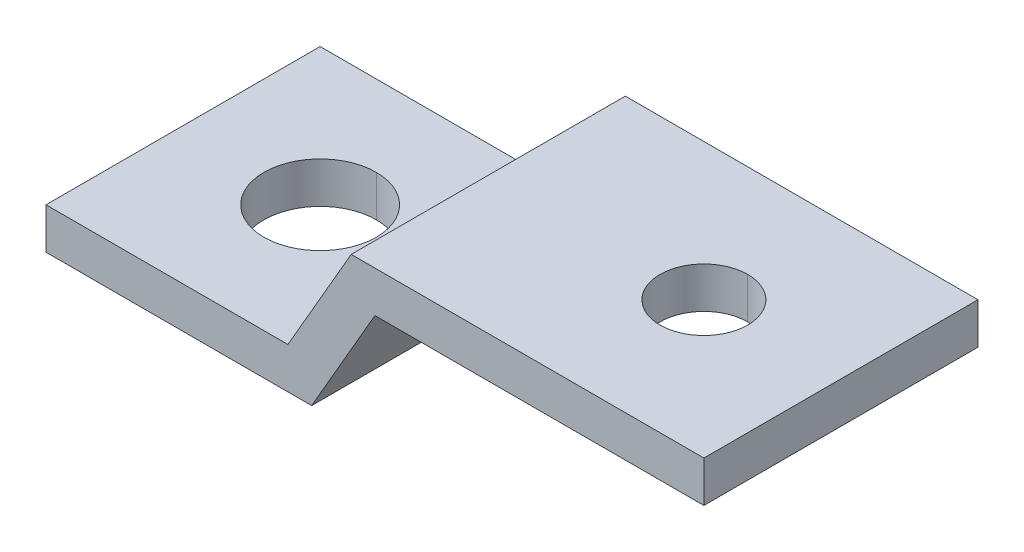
ISO-10303-21;
HEADER;
FILE_DESCRIPTION(('STEP AP214'),'2;1');
FILE_NAME('part.step','',(''),(''),'','','');
FILE_SCHEMA(('AUTOMOTIVE_DESIGN { 1 0 10303 214 1 1 1 1 }'));
ENDSEC;
DATA;
#1=APPLICATION_CONTEXT('core data for automotive mechanical design processes');
#2=APPLICATION_PROTOCOL_DEFINITION('international standard','automotive_design',2000,#1);
#3=PRODUCT_CONTEXT('',#1,'mechanical');
#4=PRODUCT('Part','Part','',(#3));
#5=PRODUCT_RELATED_PRODUCT_CATEGORY('part','',(#4));
#6=PRODUCT_DEFINITION_FORMATION('','',#4);
#7=PRODUCT_DEFINITION_CONTEXT('part definition',#1,'design');
#8=PRODUCT_DEFINITION('design','',#6,#7);
#9=PRODUCT_DEFINITION_SHAPE('','',#8);
#10=(LENGTH_UNIT() NAMED_UNIT(*) SI_UNIT(.MILLI.,.METRE.));
#11=(NAMED_UNIT(*) PLANE_ANGLE_UNIT() SI_UNIT($,.RADIAN.));
#12=(NAMED_UNIT(*) SI_UNIT($,.STERADIAN.) SOLID_ANGLE_UNIT());
#13=UNCERTAINTY_MEASURE_WITH_UNIT(LENGTH_MEASURE(1.E-05),#10,'distance_accuracy_value','');
#14=(GEOMETRIC_REPRESENTATION_CONTEXT(3) GLOBAL_UNCERTAINTY_ASSIGNED_CONTEXT((#13)) GLOBAL_UNIT_ASSIGNED_CONTEXT((#10,
#11,#12)) REPRESENTATION_CONTEXT('',''));
#15=CARTESIAN_POINT('',(0.,0.,0.));
#16=DIRECTION('',(0.,0.,1.));
#17=DIRECTION('',(1.,0.,0.));
#18=AXIS2_PLACEMENT_3D('',#15,#16,#17);
#19=CARTESIAN_POINT('',(2.89110178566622,3.9188977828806,17.2699844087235));
#20=DIRECTION('',(0.,1.,0.));
#21=DIRECTION('',(0.,0.,1.));
#22=AXIS2_PLACEMENT_3D('',#19,#20,#21);
#23=CYLINDRICAL_SURFACE('',#22,2.05);
#24=DIRECTION('',(0.,1.,0.));
#25=VECTOR('',#24,1.);
#26=CARTESIAN_POINT('',(2.89110178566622,3.9188977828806,15.2199844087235));
#27=LINE('',#26,#25);
#28=CARTESIAN_POINT('',(2.89110178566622,9.71717338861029,15.2199844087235));
#29=VERTEX_POINT('',#28);
#30=CARTESIAN_POINT('',(2.89110178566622,11.2171733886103,15.2199844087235));
#31=VERTEX_POINT('',#30);
#32=EDGE_CURVE('E144',#29,#31,#27,.T.);
#33=ORIENTED_EDGE('',*,*,#32,.F.);
#34=CARTESIAN_POINT('',(2.89110178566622,9.71717338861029,17.2699844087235));
#35=DIRECTION('',(0.,1.,0.));
#36=DIRECTION('',(0.,0.,1.));
#37=AXIS2_PLACEMENT_3D('',#34,#35,#36);
#38=CIRCLE('',#37,2.05);
#39=CARTESIAN_POINT('',(2.89110178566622,9.71717338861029,19.3199844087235));
#40=VERTEX_POINT('',#39);
#41=EDGE_CURVE('E130',#40,#29,#38,.T.);
#42=ORIENTED_EDGE('',*,*,#41,.F.);
#43=DIRECTION('',(0.,1.,0.));
#44=VECTOR('',#43,1.);
#45=CARTESIAN_POINT('',(2.89110178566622,3.9188977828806,19.3199844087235));
#46=LINE('',#45,#44);
#47=CARTESIAN_POINT('',(2.89110178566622,11.2171733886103,19.3199844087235));
#48=VERTEX_POINT('',#47);
#49=EDGE_CURVE('E153',#40,#48,#46,.T.);
#50=ORIENTED_EDGE('',*,*,#49,.T.);
#51=CARTESIAN_POINT('',(2.89110178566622,11.2171733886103,17.2699844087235));
#52=DIRECTION('',(0.,1.,0.));
#53=DIRECTION('',(0.,0.,-1.));
#54=AXIS2_PLACEMENT_3D('',#51,#52,#53);
#55=CIRCLE('',#54,2.05);
#56=EDGE_CURVE('E145',#48,#31,#55,.T.);
#57=ORIENTED_EDGE('',*,*,#56,.T.);
#58=EDGE_LOOP('',(#33,#42,#50,#57));
#59=FACE_BOUND('',#58,.T.);
#60=ADVANCED_FACE('F15',(#59),#23,.F.);
#61=CARTESIAN_POINT('',(16.8911017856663,3.9188977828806,17.2699844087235));
#62=DIRECTION('',(0.,1.,0.));
#63=DIRECTION('',(0.,0.,1.));
#64=AXIS2_PLACEMENT_3D('',#61,#62,#63);
#65=CYLINDRICAL_SURFACE('',#64,1.6);
#66=DIRECTION('',(0.,1.,0.));
#67=VECTOR('',#66,1.);
#68=CARTESIAN_POINT('',(16.8911017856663,3.9188977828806,15.6699844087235));
#69=LINE('',#68,#67);
#70=CARTESIAN_POINT('',(16.8911017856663,13.7171733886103,15.6699844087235));
#71=VERTEX_POINT('',#70);
#72=CARTESIAN_POINT('',(16.8911017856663,15.2171733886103,15.6699844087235));
#73=VERTEX_POINT('',#72);
#74=EDGE_CURVE('E173',#71,#73,#69,.T.);
#75=ORIENTED_EDGE('',*,*,#74,.F.);
#76=CARTESIAN_POINT('',(16.8911017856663,13.7171733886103,17.2699844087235));
#77=DIRECTION('',(0.,-1.,0.));
#78=DIRECTION('',(0.,0.,1.));
#79=AXIS2_PLACEMENT_3D('',#76,#77,#78);
#80=CIRCLE('',#79,1.6);
#81=CARTESIAN_POINT('',(16.8911017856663,13.7171733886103,18.8699844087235));
#82=VERTEX_POINT('',#81);
#83=EDGE_CURVE('E224',#71,#82,#80,.T.);
#84=ORIENTED_EDGE('',*,*,#83,.T.);
#85=DIRECTION('',(0.,1.,0.));
#86=VECTOR('',#85,1.);
#87=CARTESIAN_POINT('',(16.8911017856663,3.9188977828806,18.8699844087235));
#88=LINE('',#87,#86);
#89=CARTESIAN_POINT('',(16.8911017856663,15.2171733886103,18.8699844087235));
#90=VERTEX_POINT('',#89);
#91=EDGE_CURVE('E182',#82,#90,#88,.T.);
#92=ORIENTED_EDGE('',*,*,#91,.T.);
#93=CARTESIAN_POINT('',(16.8911017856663,15.2171733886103,17.2699844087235));
#94=DIRECTION('',(0.,-1.,0.));
#95=DIRECTION('',(0.,0.,-1.));
#96=AXIS2_PLACEMENT_3D('',#93,#94,#95);
#97=CIRCLE('',#96,1.6);
#98=EDGE_CURVE('E241',#73,#90,#97,.T.);
#99=ORIENTED_EDGE('',*,*,#98,.F.);
#100=EDGE_LOOP('',(#75,#84,#92,#99));
#101=FACE_BOUND('',#100,.T.);
#102=ADVANCED_FACE('F304',(#101),#65,.F.);
#103=CARTESIAN_POINT('',(-2.10889821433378,11.2171733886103,12.2699844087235));
#104=DIRECTION('',(0.,0.,1.));
#105=DIRECTION('',(1.,0.,0.));
#106=AXIS2_PLACEMENT_3D('',#103,#104,#105);
#107=PLANE('',#106);
#108=DIRECTION('',(0.,-1.,0.));
#109=VECTOR('',#108,1.);
#110=CARTESIAN_POINT('',(-2.10889821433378,11.2171733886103,12.2699844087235));
#111=LINE('',#110,#109);
#112=CARTESIAN_POINT('',(-2.10889821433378,11.2171733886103,12.2699844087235));
#113=VERTEX_POINT('',#112);
#114=CARTESIAN_POINT('',(-2.10889821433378,9.71717338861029,12.2699844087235));
#115=VERTEX_POINT('',#114);
#116=EDGE_CURVE('E244',#113,#115,#111,.T.);
#117=ORIENTED_EDGE('',*,*,#116,.F.);
#118=DIRECTION('',(-1.,0.,0.));
#119=VECTOR('',#118,1.);
#120=CARTESIAN_POINT('',(-2.10889821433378,11.2171733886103,12.2699844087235));
#121=LINE('',#120,#119);
#122=CARTESIAN_POINT('',(6.71567530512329,11.2171733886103,12.2699844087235));
#123=VERTEX_POINT('',#122);
#124=EDGE_CURVE('E140',#123,#113,#121,.T.);
#125=ORIENTED_EDGE('',*,*,#124,.F.);
#126=DIRECTION('',(-0.5,-0.86602540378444,0.));
#127=VECTOR('',#126,1.);
#128=CARTESIAN_POINT('',(6.71567530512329,11.2171733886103,12.2699844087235));
#129=LINE('',#128,#127);
#130=CARTESIAN_POINT('',(9.02507638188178,15.2171733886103,12.2699844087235));
#131=VERTEX_POINT('',#130);
#132=EDGE_CURVE('E19',#131,#123,#129,.T.);
#133=ORIENTED_EDGE('',*,*,#132,.F.);
#134=DIRECTION('',(-1.,0.,0.));
#135=VECTOR('',#134,1.);
#136=CARTESIAN_POINT('',(9.02507638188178,15.2171733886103,12.2699844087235));
#137=LINE('',#136,#135);
#138=CARTESIAN_POINT('',(21.8911017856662,15.2171733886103,12.2699844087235));
#139=VERTEX_POINT('',#138);
#140=EDGE_CURVE('E227',#139,#131,#137,.T.);
#141=ORIENTED_EDGE('',*,*,#140,.F.);
#142=DIRECTION('',(0.,1.,0.));
#143=VECTOR('',#142,1.);
#144=CARTESIAN_POINT('',(21.8911017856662,13.7171733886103,12.2699844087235));
#145=LINE('',#144,#143);
#146=CARTESIAN_POINT('',(21.8911017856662,13.7171733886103,12.2699844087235));
#147=VERTEX_POINT('',#146);
#148=EDGE_CURVE('E256',#147,#139,#145,.T.);
#149=ORIENTED_EDGE('',*,*,#148,.F.);
#150=DIRECTION('',(1.,0.,0.));
#151=VECTOR('',#150,1.);
#152=CARTESIAN_POINT('',(9.89110178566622,13.7171733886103,12.2699844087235));
#153=LINE('',#152,#151);
#154=CARTESIAN_POINT('',(9.89110178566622,13.7171733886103,12.2699844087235));
#155=VERTEX_POINT('',#154);
#156=EDGE_CURVE('E209',#155,#147,#153,.T.);
#157=ORIENTED_EDGE('',*,*,#156,.F.);
#158=DIRECTION('',(0.5,0.86602540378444,0.));
#159=VECTOR('',#158,1.);
#160=CARTESIAN_POINT('',(7.58170070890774,9.71717338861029,12.2699844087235));
#161=LINE('',#160,#159);
#162=CARTESIAN_POINT('',(7.58170070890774,9.71717338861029,12.2699844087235));
#163=VERTEX_POINT('',#162);
#164=EDGE_CURVE('E250',#163,#155,#161,.T.);
#165=ORIENTED_EDGE('',*,*,#164,.F.);
#166=DIRECTION('',(1.,0.,0.));
#167=VECTOR('',#166,1.);
#168=CARTESIAN_POINT('',(-2.10889821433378,9.71717338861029,12.2699844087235));
#169=LINE('',#168,#167);
#170=EDGE_CURVE('E162',#115,#163,#169,.T.);
#171=ORIENTED_EDGE('',*,*,#170,.F.);
#172=EDGE_LOOP('',(#117,#125,#133,#141,#149,#157,#165,#171));
#173=FACE_BOUND('',#172,.T.);
#174=ADVANCED_FACE('F17',(#173),#107,.F.);
#175=CARTESIAN_POINT('',(-2.10889821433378,11.2171733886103,22.2699844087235));
#176=DIRECTION('',(0.,0.,1.));
#177=DIRECTION('',(1.,0.,0.));
#178=AXIS2_PLACEMENT_3D('',#175,#176,#177);
#179=PLANE('',#178);
#180=DIRECTION('',(0.,-1.,0.));
#181=VECTOR('',#180,1.);
#182=CARTESIAN_POINT('',(-2.10889821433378,11.2171733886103,22.2699844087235));
#183=LINE('',#182,#181);
#184=CARTESIAN_POINT('',(-2.10889821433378,11.2171733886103,22.2699844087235));
#185=VERTEX_POINT('',#184);
#186=CARTESIAN_POINT('',(-2.10889821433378,9.71717338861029,22.2699844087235));
#187=VERTEX_POINT('',#186);
#188=EDGE_CURVE('E247',#185,#187,#183,.T.);
#189=ORIENTED_EDGE('',*,*,#188,.T.);
#190=DIRECTION('',(1.,0.,0.));
#191=VECTOR('',#190,1.);
#192=CARTESIAN_POINT('',(-2.10889821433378,9.71717338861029,22.2699844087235));
#193=LINE('',#192,#191);
#194=CARTESIAN_POINT('',(7.58170070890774,9.71717338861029,22.2699844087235));
#195=VERTEX_POINT('',#194);
#196=EDGE_CURVE('E161',#187,#195,#193,.T.);
#197=ORIENTED_EDGE('',*,*,#196,.T.);
#198=DIRECTION('',(0.5,0.86602540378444,0.));
#199=VECTOR('',#198,1.);
#200=CARTESIAN_POINT('',(7.58170070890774,9.71717338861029,22.2699844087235));
#201=LINE('',#200,#199);
#202=CARTESIAN_POINT('',(9.89110178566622,13.7171733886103,22.2699844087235));
#203=VERTEX_POINT('',#202);
#204=EDGE_CURVE('E253',#195,#203,#201,.T.);
#205=ORIENTED_EDGE('',*,*,#204,.T.);
#206=DIRECTION('',(1.,0.,0.));
#207=VECTOR('',#206,1.);
#208=CARTESIAN_POINT('',(9.89110178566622,13.7171733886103,22.2699844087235));
#209=LINE('',#208,#207);
#210=CARTESIAN_POINT('',(21.8911017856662,13.7171733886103,22.2699844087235));
#211=VERTEX_POINT('',#210);
#212=EDGE_CURVE('E217',#203,#211,#209,.T.);
#213=ORIENTED_EDGE('',*,*,#212,.T.);
#214=DIRECTION('',(0.,1.,0.));
#215=VECTOR('',#214,1.);
#216=CARTESIAN_POINT('',(21.8911017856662,13.7171733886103,22.2699844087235));
#217=LINE('',#216,#215);
#218=CARTESIAN_POINT('',(21.8911017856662,15.2171733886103,22.2699844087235));
#219=VERTEX_POINT('',#218);
#220=EDGE_CURVE('E35',#211,#219,#217,.T.);
#221=ORIENTED_EDGE('',*,*,#220,.T.);
#222=DIRECTION('',(-1.,0.,0.));
#223=VECTOR('',#222,1.);
#224=CARTESIAN_POINT('',(9.02507638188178,15.2171733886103,22.2699844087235));
#225=LINE('',#224,#223);
#226=CARTESIAN_POINT('',(9.02507638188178,15.2171733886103,22.2699844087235));
#227=VERTEX_POINT('',#226);
#228=EDGE_CURVE('E234',#219,#227,#225,.T.);
#229=ORIENTED_EDGE('',*,*,#228,.T.);
#230=DIRECTION('',(-0.5,-0.86602540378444,0.));
#231=VECTOR('',#230,1.);
#232=CARTESIAN_POINT('',(6.71567530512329,11.2171733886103,22.2699844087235));
#233=LINE('',#232,#231);
#234=CARTESIAN_POINT('',(6.71567530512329,11.2171733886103,22.2699844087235));
#235=VERTEX_POINT('',#234);
#236=EDGE_CURVE('E10',#227,#235,#233,.T.);
#237=ORIENTED_EDGE('',*,*,#236,.T.);
#238=DIRECTION('',(-1.,0.,0.));
#239=VECTOR('',#238,1.);
#240=CARTESIAN_POINT('',(-2.10889821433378,11.2171733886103,22.2699844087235));
#241=LINE('',#240,#239);
#242=EDGE_CURVE('E187',#235,#185,#241,.T.);
#243=ORIENTED_EDGE('',*,*,#242,.T.);
#244=EDGE_LOOP('',(#189,#197,#205,#213,#221,#229,#237,#243));
#245=FACE_BOUND('',#244,.T.);
#246=ADVANCED_FACE('F275',(#245),#179,.T.);
#247=CARTESIAN_POINT('',(6.71567530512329,11.2171733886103,22.2699844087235));
#248=DIRECTION('',(0.86602540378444,-0.5,0.));
#249=DIRECTION('',(0.,0.,-1.));
#250=AXIS2_PLACEMENT_3D('',#247,#248,#249);
#251=PLANE('',#250);
#252=ORIENTED_EDGE('',*,*,#132,.T.);
#253=DIRECTION('',(0.,0.,-1.));
#254=VECTOR('',#253,1.);
#255=CARTESIAN_POINT('',(6.71567530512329,11.2171733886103,22.2699844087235));
#256=LINE('',#255,#254);
#257=EDGE_CURVE('E203',#235,#123,#256,.T.);
#258=ORIENTED_EDGE('',*,*,#257,.F.);
#259=ORIENTED_EDGE('',*,*,#236,.F.);
#260=DIRECTION('',(0.,0.,-1.));
#261=VECTOR('',#260,1.);
#262=CARTESIAN_POINT('',(9.02507638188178,15.2171733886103,22.2699844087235));
#263=LINE('',#262,#261);
#264=EDGE_CURVE('E231',#227,#131,#263,.T.);
#265=ORIENTED_EDGE('',*,*,#264,.T.);
#266=EDGE_LOOP('',(#252,#258,#259,#265));
#267=FACE_BOUND('',#266,.T.);
#268=ADVANCED_FACE('F261',(#267),#251,.F.);
#269=CARTESIAN_POINT('',(21.8911017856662,13.7171733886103,22.2699844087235));
#270=DIRECTION('',(-1.,0.,0.));
#271=DIRECTION('',(0.,0.,1.));
#272=AXIS2_PLACEMENT_3D('',#269,#270,#271);
#273=PLANE('',#272);
#274=ORIENTED_EDGE('',*,*,#148,.T.);
#275=DIRECTION('',(0.,0.,-1.));
#276=VECTOR('',#275,1.);
#277=CARTESIAN_POINT('',(21.8911017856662,15.2171733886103,22.2699844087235));
#278=LINE('',#277,#276);
#279=EDGE_CURVE('E237',#219,#139,#278,.T.);
#280=ORIENTED_EDGE('',*,*,#279,.F.);
#281=ORIENTED_EDGE('',*,*,#220,.F.);
#282=DIRECTION('',(0.,0.,-1.));
#283=VECTOR('',#282,1.);
#284=CARTESIAN_POINT('',(21.8911017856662,13.7171733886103,22.2699844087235));
#285=LINE('',#284,#283);
#286=EDGE_CURVE('E213',#211,#147,#285,.T.);
#287=ORIENTED_EDGE('',*,*,#286,.T.);
#288=EDGE_LOOP('',(#274,#280,#281,#287));
#289=FACE_BOUND('',#288,.T.);
#290=ADVANCED_FACE('F282',(#289),#273,.F.);
#291=CARTESIAN_POINT('',(7.58170070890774,9.71717338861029,22.2699844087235));
#292=DIRECTION('',(-0.86602540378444,0.5,0.));
#293=DIRECTION('',(0.,0.,1.));
#294=AXIS2_PLACEMENT_3D('',#291,#292,#293);
#295=PLANE('',#294);
#296=ORIENTED_EDGE('',*,*,#164,.T.);
#297=DIRECTION('',(0.,0.,-1.));
#298=VECTOR('',#297,1.);
#299=CARTESIAN_POINT('',(9.89110178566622,13.7171733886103,22.2699844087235));
#300=LINE('',#299,#298);
#301=EDGE_CURVE('E220',#203,#155,#300,.T.);
#302=ORIENTED_EDGE('',*,*,#301,.F.);
#303=ORIENTED_EDGE('',*,*,#204,.F.);
#304=DIRECTION('',(0.,0.,-1.));
#305=VECTOR('',#304,1.);
#306=CARTESIAN_POINT('',(7.58170070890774,9.71717338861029,22.2699844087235));
#307=LINE('',#306,#305);
#308=EDGE_CURVE('E157',#195,#163,#307,.T.);
#309=ORIENTED_EDGE('',*,*,#308,.T.);
#310=EDGE_LOOP('',(#296,#302,#303,#309));
#311=FACE_BOUND('',#310,.T.);
#312=ADVANCED_FACE('F288',(#311),#295,.F.);
#313=CARTESIAN_POINT('',(-2.10889821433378,11.2171733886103,22.2699844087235));
#314=DIRECTION('',(1.,0.,0.));
#315=DIRECTION('',(0.,1.,0.));
#316=AXIS2_PLACEMENT_3D('',#313,#314,#315);
#317=PLANE('',#316);
#318=ORIENTED_EDGE('',*,*,#116,.T.);
#319=DIRECTION('',(0.,0.,-1.));
#320=VECTOR('',#319,1.);
#321=CARTESIAN_POINT('',(-2.10889821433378,9.71717338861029,22.2699844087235));
#322=LINE('',#321,#320);
#323=EDGE_CURVE('E141',#187,#115,#322,.T.);
#324=ORIENTED_EDGE('',*,*,#323,.F.);
#325=ORIENTED_EDGE('',*,*,#188,.F.);
#326=DIRECTION('',(0.,0.,-1.));
#327=VECTOR('',#326,1.);
#328=CARTESIAN_POINT('',(-2.10889821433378,11.2171733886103,22.2699844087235));
#329=LINE('',#328,#327);
#330=EDGE_CURVE('E183',#185,#113,#329,.T.);
#331=ORIENTED_EDGE('',*,*,#330,.T.);
#332=EDGE_LOOP('',(#318,#324,#325,#331));
#333=FACE_BOUND('',#332,.T.);
#334=ADVANCED_FACE('F273',(#333),#317,.F.);
#335=CARTESIAN_POINT('',(9.02507638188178,15.2171733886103,22.2699844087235));
#336=DIRECTION('',(0.,-1.,0.));
#337=DIRECTION('',(0.,0.,-1.));
#338=AXIS2_PLACEMENT_3D('',#335,#336,#337);
#339=PLANE('',#338);
#340=CARTESIAN_POINT('',(16.8911017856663,15.2171733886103,17.2699844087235));
#341=DIRECTION('',(0.,-1.,0.));
#342=DIRECTION('',(0.,0.,-1.));
#343=AXIS2_PLACEMENT_3D('',#340,#341,#342);
#344=CIRCLE('',#343,1.6);
#345=EDGE_CURVE('E178',#90,#73,#344,.T.);
#346=ORIENTED_EDGE('',*,*,#345,.T.);
#347=ORIENTED_EDGE('',*,*,#98,.T.);
#348=EDGE_LOOP('',(#346,#347));
#349=FACE_BOUND('',#348,.T.);
#350=ORIENTED_EDGE('',*,*,#140,.T.);
#351=ORIENTED_EDGE('',*,*,#264,.F.);
#352=ORIENTED_EDGE('',*,*,#228,.F.);
#353=ORIENTED_EDGE('',*,*,#279,.T.);
#354=EDGE_LOOP('',(#350,#351,#352,#353));
#355=FACE_BOUND('',#354,.T.);
#356=ADVANCED_FACE('F278',(#349,#355),#339,.F.);
#357=CARTESIAN_POINT('',(9.89110178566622,13.7171733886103,22.2699844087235));
#358=DIRECTION('',(0.,1.,0.));
#359=DIRECTION('',(1.,0.,0.));
#360=AXIS2_PLACEMENT_3D('',#357,#358,#359);
#361=PLANE('',#360);
#362=CARTESIAN_POINT('',(16.8911017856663,13.7171733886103,17.2699844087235));
#363=DIRECTION('',(0.,-1.,0.));
#364=DIRECTION('',(0.,0.,1.));
#365=AXIS2_PLACEMENT_3D('',#362,#363,#364);
#366=CIRCLE('',#365,1.6);
#367=EDGE_CURVE('E170',#82,#71,#366,.T.);
#368=ORIENTED_EDGE('',*,*,#367,.F.);
#369=ORIENTED_EDGE('',*,*,#83,.F.);
#370=EDGE_LOOP('',(#368,#369));
#371=FACE_BOUND('',#370,.T.);
#372=ORIENTED_EDGE('',*,*,#156,.T.);
#373=ORIENTED_EDGE('',*,*,#286,.F.);
#374=ORIENTED_EDGE('',*,*,#212,.F.);
#375=ORIENTED_EDGE('',*,*,#301,.T.);
#376=EDGE_LOOP('',(#372,#373,#374,#375));
#377=FACE_BOUND('',#376,.T.);
#378=ADVANCED_FACE('F285',(#371,#377),#361,.F.);
#379=CARTESIAN_POINT('',(-2.10889821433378,11.2171733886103,22.2699844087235));
#380=DIRECTION('',(0.,-1.,0.));
#381=DIRECTION('',(0.,0.,-1.));
#382=AXIS2_PLACEMENT_3D('',#379,#380,#381);
#383=PLANE('',#382);
#384=ORIENTED_EDGE('',*,*,#56,.F.);
#385=CARTESIAN_POINT('',(2.89110178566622,11.2171733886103,17.2699844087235));
#386=DIRECTION('',(0.,1.,0.));
#387=DIRECTION('',(0.,0.,-1.));
#388=AXIS2_PLACEMENT_3D('',#385,#386,#387);
#389=CIRCLE('',#388,2.05);
#390=EDGE_CURVE('E150',#31,#48,#389,.T.);
#391=ORIENTED_EDGE('',*,*,#390,.F.);
#392=EDGE_LOOP('',(#384,#391));
#393=FACE_BOUND('',#392,.T.);
#394=ORIENTED_EDGE('',*,*,#124,.T.);
#395=ORIENTED_EDGE('',*,*,#330,.F.);
#396=ORIENTED_EDGE('',*,*,#242,.F.);
#397=ORIENTED_EDGE('',*,*,#257,.T.);
#398=EDGE_LOOP('',(#394,#395,#396,#397));
#399=FACE_BOUND('',#398,.T.);
#400=ADVANCED_FACE('F268',(#393,#399),#383,.F.);
#401=CARTESIAN_POINT('',(-2.10889821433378,9.71717338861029,22.2699844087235));
#402=DIRECTION('',(0.,1.,0.));
#403=DIRECTION('',(1.,0.,0.));
#404=AXIS2_PLACEMENT_3D('',#401,#402,#403);
#405=PLANE('',#404);
#406=ORIENTED_EDGE('',*,*,#41,.T.);
#407=CARTESIAN_POINT('',(2.89110178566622,9.71717338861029,17.2699844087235));
#408=DIRECTION('',(0.,1.,0.));
#409=DIRECTION('',(0.,0.,1.));
#410=AXIS2_PLACEMENT_3D('',#407,#408,#409);
#411=CIRCLE('',#410,2.05);
#412=EDGE_CURVE('E135',#29,#40,#411,.T.);
#413=ORIENTED_EDGE('',*,*,#412,.T.);
#414=EDGE_LOOP('',(#406,#413));
#415=FACE_BOUND('',#414,.T.);
#416=ORIENTED_EDGE('',*,*,#170,.T.);
#417=ORIENTED_EDGE('',*,*,#308,.F.);
#418=ORIENTED_EDGE('',*,*,#196,.F.);
#419=ORIENTED_EDGE('',*,*,#323,.T.);
#420=EDGE_LOOP('',(#416,#417,#418,#419));
#421=FACE_BOUND('',#420,.T.);
#422=ADVANCED_FACE('F132',(#415,#421),#405,.F.);
#423=CARTESIAN_POINT('',(16.8911017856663,3.9188977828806,17.2699844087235));
#424=DIRECTION('',(0.,1.,0.));
#425=DIRECTION('',(0.,0.,1.));
#426=AXIS2_PLACEMENT_3D('',#423,#424,#425);
#427=CYLINDRICAL_SURFACE('',#426,1.6);
#428=ORIENTED_EDGE('',*,*,#367,.T.);
#429=ORIENTED_EDGE('',*,*,#74,.T.);
#430=ORIENTED_EDGE('',*,*,#345,.F.);
#431=ORIENTED_EDGE('',*,*,#91,.F.);
#432=EDGE_LOOP('',(#428,#429,#430,#431));
#433=FACE_BOUND('',#432,.T.);
#434=ADVANCED_FACE('F291',(#433),#427,.F.);
#435=CARTESIAN_POINT('',(2.89110178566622,3.9188977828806,17.2699844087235));
#436=DIRECTION('',(0.,1.,0.));
#437=DIRECTION('',(0.,0.,1.));
#438=AXIS2_PLACEMENT_3D('',#435,#436,#437);
#439=CYLINDRICAL_SURFACE('',#438,2.05);
#440=ORIENTED_EDGE('',*,*,#412,.F.);
#441=ORIENTED_EDGE('',*,*,#32,.T.);
#442=ORIENTED_EDGE('',*,*,#390,.T.);
#443=ORIENTED_EDGE('',*,*,#49,.F.);
#444=EDGE_LOOP('',(#440,#441,#442,#443));
#445=FACE_BOUND('',#444,.T.);
#446=ADVANCED_FACE('F152',(#445),#439,.F.);
#447=CLOSED_SHELL('',(#60,#102,#174,#246,#268,#290,#312,#334,#356,#378,#400,#422,#434,#446));
#448=MANIFOLD_SOLID_BREP('B1',#447);
#449=ADVANCED_BREP_SHAPE_REPRESENTATION('',(#18,#448),#14);
#450=SHAPE_DEFINITION_REPRESENTATION(#9,#449);
ENDSEC;
END-ISO-10303-21;
